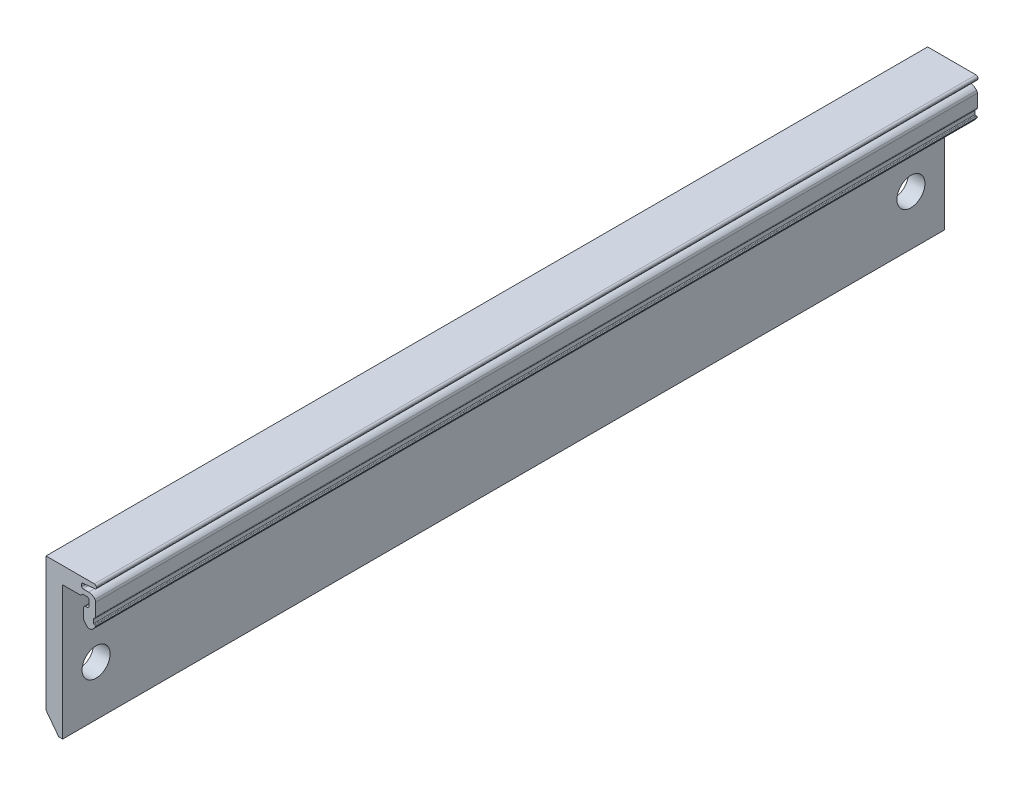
ISO-10303-21;
HEADER;
FILE_DESCRIPTION(('STEP AP214'),'2;1');
FILE_NAME('part.step','',(''),(''),'','','');
FILE_SCHEMA(('AUTOMOTIVE_DESIGN { 1 0 10303 214 1 1 1 1 }'));
ENDSEC;
DATA;
#1=APPLICATION_CONTEXT('core data for automotive mechanical design processes');
#2=APPLICATION_PROTOCOL_DEFINITION('international standard','automotive_design',2000,#1);
#3=PRODUCT_CONTEXT('',#1,'mechanical');
#4=PRODUCT('Part','Part','',(#3));
#5=PRODUCT_RELATED_PRODUCT_CATEGORY('part','',(#4));
#6=PRODUCT_DEFINITION_FORMATION('','',#4);
#7=PRODUCT_DEFINITION_CONTEXT('part definition',#1,'design');
#8=PRODUCT_DEFINITION('design','',#6,#7);
#9=PRODUCT_DEFINITION_SHAPE('','',#8);
#10=(LENGTH_UNIT() NAMED_UNIT(*) SI_UNIT(.MILLI.,.METRE.));
#11=(NAMED_UNIT(*) PLANE_ANGLE_UNIT() SI_UNIT($,.RADIAN.));
#12=(NAMED_UNIT(*) SI_UNIT($,.STERADIAN.) SOLID_ANGLE_UNIT());
#13=UNCERTAINTY_MEASURE_WITH_UNIT(LENGTH_MEASURE(1.E-05),#10,'distance_accuracy_value','');
#14=(GEOMETRIC_REPRESENTATION_CONTEXT(3) GLOBAL_UNCERTAINTY_ASSIGNED_CONTEXT((#13)) GLOBAL_UNIT_ASSIGNED_CONTEXT((#10,
#11,#12)) REPRESENTATION_CONTEXT('',''));
#15=CARTESIAN_POINT('',(0.,0.,0.));
#16=DIRECTION('',(0.,0.,1.));
#17=DIRECTION('',(1.,0.,0.));
#18=AXIS2_PLACEMENT_3D('',#15,#16,#17);
#19=CARTESIAN_POINT('',(2350.3840351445,-3290.10376988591,66.));
#20=DIRECTION('',(0.,-1.,0.));
#21=DIRECTION('',(0.,0.,-1.));
#22=AXIS2_PLACEMENT_3D('',#19,#20,#21);
#23=PLANE('',#22);
#24=DIRECTION('',(-1.,0.,0.));
#25=VECTOR('',#24,1.);
#26=CARTESIAN_POINT('',(2350.3840351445,-3290.10376988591,-66.));
#27=LINE('',#26,#25);
#28=CARTESIAN_POINT('',(2357.62403514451,-3290.10376988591,-66.));
#29=VERTEX_POINT('',#28);
#30=CARTESIAN_POINT('',(2350.3840351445,-3290.10376988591,-66.));
#31=VERTEX_POINT('',#30);
#32=EDGE_CURVE('E178',#29,#31,#27,.T.);
#33=ORIENTED_EDGE('',*,*,#32,.T.);
#34=DIRECTION('',(0.,0.,-1.));
#35=VECTOR('',#34,1.);
#36=CARTESIAN_POINT('',(2350.3840351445,-3290.10376988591,66.));
#37=LINE('',#36,#35);
#38=CARTESIAN_POINT('',(2350.3840351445,-3290.10376988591,66.));
#39=VERTEX_POINT('',#38);
#40=EDGE_CURVE('E11',#39,#31,#37,.T.);
#41=ORIENTED_EDGE('',*,*,#40,.F.);
#42=DIRECTION('',(-1.,0.,0.));
#43=VECTOR('',#42,1.);
#44=CARTESIAN_POINT('',(2355.38403514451,-3290.10376988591,66.));
#45=LINE('',#44,#43);
#46=CARTESIAN_POINT('',(2357.62403514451,-3290.10376988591,66.));
#47=VERTEX_POINT('',#46);
#48=EDGE_CURVE('E184',#47,#39,#45,.T.);
#49=ORIENTED_EDGE('',*,*,#48,.F.);
#50=DIRECTION('',(0.,0.,-1.));
#51=VECTOR('',#50,1.);
#52=CARTESIAN_POINT('',(2357.62403514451,-3290.10376988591,66.));
#53=LINE('',#52,#51);
#54=EDGE_CURVE('E308',#47,#29,#53,.T.);
#55=ORIENTED_EDGE('',*,*,#54,.T.);
#56=EDGE_LOOP('',(#33,#41,#49,#55));
#57=FACE_BOUND('',#56,.T.);
#58=ADVANCED_FACE('F34',(#57),#23,.F.);
#59=CARTESIAN_POINT('',(2350.3840351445,-3292.60376988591,66.));
#60=DIRECTION('',(1.,0.,0.));
#61=DIRECTION('',(0.,0.,-1.));
#62=AXIS2_PLACEMENT_3D('',#59,#60,#61);
#63=PLANE('',#62);
#64=CARTESIAN_POINT('',(2350.38403514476,-3305.10376988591,61.));
#65=DIRECTION('',(-1.,0.,0.));
#66=DIRECTION('',(0.,1.,0.));
#67=AXIS2_PLACEMENT_3D('',#64,#65,#66);
#68=CIRCLE('',#67,2.09999999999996);
#69=CARTESIAN_POINT('',(2350.38403514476,-3303.00376988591,61.));
#70=VERTEX_POINT('',#69);
#71=EDGE_CURVE('E497',#70,#70,#68,.T.);
#72=ORIENTED_EDGE('',*,*,#71,.F.);
#73=EDGE_LOOP('',(#72));
#74=FACE_BOUND('',#73,.T.);
#75=CARTESIAN_POINT('',(2350.38403514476,-3305.10376988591,-61.));
#76=DIRECTION('',(-1.,0.,0.));
#77=DIRECTION('',(0.,-1.,0.));
#78=AXIS2_PLACEMENT_3D('',#75,#76,#77);
#79=CIRCLE('',#78,2.09999999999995);
#80=CARTESIAN_POINT('',(2350.38403514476,-3307.20376988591,-61.));
#81=VERTEX_POINT('',#80);
#82=EDGE_CURVE('E489',#81,#81,#79,.T.);
#83=ORIENTED_EDGE('',*,*,#82,.F.);
#84=EDGE_LOOP('',(#83));
#85=FACE_BOUND('',#84,.T.);
#86=DIRECTION('',(0.,-1.,0.));
#87=VECTOR('',#86,1.);
#88=CARTESIAN_POINT('',(2350.3840351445,-3292.60376988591,-66.));
#89=LINE('',#88,#87);
#90=CARTESIAN_POINT('',(2350.3840351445,-3310.10376988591,-66.));
#91=VERTEX_POINT('',#90);
#92=EDGE_CURVE('E313',#31,#91,#89,.T.);
#93=ORIENTED_EDGE('',*,*,#92,.T.);
#94=DIRECTION('',(0.,0.,-1.));
#95=VECTOR('',#94,1.);
#96=CARTESIAN_POINT('',(2350.3840351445,-3310.10376988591,66.));
#97=LINE('',#96,#95);
#98=CARTESIAN_POINT('',(2350.3840351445,-3310.10376988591,66.));
#99=VERTEX_POINT('',#98);
#100=EDGE_CURVE('E43',#99,#91,#97,.T.);
#101=ORIENTED_EDGE('',*,*,#100,.F.);
#102=DIRECTION('',(0.,-1.,0.));
#103=VECTOR('',#102,1.);
#104=CARTESIAN_POINT('',(2350.3840351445,-3292.60376988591,66.));
#105=LINE('',#104,#103);
#106=EDGE_CURVE('E501',#39,#99,#105,.T.);
#107=ORIENTED_EDGE('',*,*,#106,.F.);
#108=ORIENTED_EDGE('',*,*,#40,.T.);
#109=EDGE_LOOP('',(#93,#101,#107,#108));
#110=FACE_BOUND('',#109,.T.);
#111=ADVANCED_FACE('F583',(#74,#85,#110),#63,.F.);
#112=CARTESIAN_POINT('',(2350.3840351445,-3310.10376988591,66.));
#113=DIRECTION('',(0.796162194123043,0.605083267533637,0.));
#114=DIRECTION('',(-0.605083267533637,0.796162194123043,0.));
#115=AXIS2_PLACEMENT_3D('',#112,#113,#114);
#116=PLANE('',#115);
#117=DIRECTION('',(0.605083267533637,-0.796162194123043,0.));
#118=VECTOR('',#117,1.);
#119=CARTESIAN_POINT('',(2350.3840351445,-3310.10376988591,-66.));
#120=LINE('',#119,#118);
#121=CARTESIAN_POINT('',(2352.2840351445,-3312.60376988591,-66.));
#122=VERTEX_POINT('',#121);
#123=EDGE_CURVE('E316',#91,#122,#120,.T.);
#124=ORIENTED_EDGE('',*,*,#123,.T.);
#125=DIRECTION('',(0.,0.,-1.));
#126=VECTOR('',#125,1.);
#127=CARTESIAN_POINT('',(2352.2840351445,-3312.60376988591,66.));
#128=LINE('',#127,#126);
#129=CARTESIAN_POINT('',(2352.2840351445,-3312.60376988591,66.));
#130=VERTEX_POINT('',#129);
#131=EDGE_CURVE('E484',#130,#122,#128,.T.);
#132=ORIENTED_EDGE('',*,*,#131,.F.);
#133=DIRECTION('',(0.605083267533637,-0.796162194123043,0.));
#134=VECTOR('',#133,1.);
#135=CARTESIAN_POINT('',(2350.3840351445,-3310.10376988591,66.));
#136=LINE('',#135,#134);
#137=EDGE_CURVE('E503',#99,#130,#136,.T.);
#138=ORIENTED_EDGE('',*,*,#137,.F.);
#139=ORIENTED_EDGE('',*,*,#100,.T.);
#140=EDGE_LOOP('',(#124,#132,#138,#139));
#141=FACE_BOUND('',#140,.T.);
#142=ADVANCED_FACE('F589',(#141),#116,.F.);
#143=CARTESIAN_POINT('',(2352.8840351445,-3312.60376988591,66.));
#144=DIRECTION('',(0.,1.,0.));
#145=DIRECTION('',(0.,0.,1.));
#146=AXIS2_PLACEMENT_3D('',#143,#144,#145);
#147=PLANE('',#146);
#148=DIRECTION('',(1.,0.,0.));
#149=VECTOR('',#148,1.);
#150=CARTESIAN_POINT('',(2352.8840351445,-3312.60376988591,-66.));
#151=LINE('',#150,#149);
#152=CARTESIAN_POINT('',(2352.8840351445,-3312.60376988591,-66.));
#153=VERTEX_POINT('',#152);
#154=EDGE_CURVE('E318',#122,#153,#151,.T.);
#155=ORIENTED_EDGE('',*,*,#154,.T.);
#156=DIRECTION('',(0.,0.,-1.));
#157=VECTOR('',#156,1.);
#158=CARTESIAN_POINT('',(2352.8840351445,-3312.60376988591,66.));
#159=LINE('',#158,#157);
#160=CARTESIAN_POINT('',(2352.8840351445,-3312.60376988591,66.));
#161=VERTEX_POINT('',#160);
#162=EDGE_CURVE('E481',#161,#153,#159,.T.);
#163=ORIENTED_EDGE('',*,*,#162,.F.);
#164=DIRECTION('',(1.,0.,0.));
#165=VECTOR('',#164,1.);
#166=CARTESIAN_POINT('',(2352.8840351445,-3312.60376988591,66.));
#167=LINE('',#166,#165);
#168=EDGE_CURVE('E505',#130,#161,#167,.T.);
#169=ORIENTED_EDGE('',*,*,#168,.F.);
#170=ORIENTED_EDGE('',*,*,#131,.T.);
#171=EDGE_LOOP('',(#155,#163,#169,#170));
#172=FACE_BOUND('',#171,.T.);
#173=ADVANCED_FACE('F593',(#172),#147,.F.);
#174=CARTESIAN_POINT('',(2352.88403514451,-3292.60376988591,66.));
#175=DIRECTION('',(-1.,0.,0.));
#176=DIRECTION('',(0.,-1.,0.));
#177=AXIS2_PLACEMENT_3D('',#174,#175,#176);
#178=PLANE('',#177);
#179=CARTESIAN_POINT('',(2352.88403514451,-3305.10376988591,61.));
#180=DIRECTION('',(-1.,0.,0.));
#181=DIRECTION('',(0.,-1.,0.));
#182=AXIS2_PLACEMENT_3D('',#179,#180,#181);
#183=CIRCLE('',#182,2.09999999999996);
#184=CARTESIAN_POINT('',(2352.88403514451,-3307.20376988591,61.));
#185=VERTEX_POINT('',#184);
#186=EDGE_CURVE('E37',#185,#185,#183,.T.);
#187=ORIENTED_EDGE('',*,*,#186,.T.);
#188=EDGE_LOOP('',(#187));
#189=FACE_BOUND('',#188,.T.);
#190=CARTESIAN_POINT('',(2352.88403514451,-3305.10376988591,-61.));
#191=DIRECTION('',(-1.,0.,0.));
#192=DIRECTION('',(0.,-1.,0.));
#193=AXIS2_PLACEMENT_3D('',#190,#191,#192);
#194=CIRCLE('',#193,2.09999999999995);
#195=CARTESIAN_POINT('',(2352.88403514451,-3307.20376988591,-61.));
#196=VERTEX_POINT('',#195);
#197=EDGE_CURVE('E314',#196,#196,#194,.T.);
#198=ORIENTED_EDGE('',*,*,#197,.T.);
#199=EDGE_LOOP('',(#198));
#200=FACE_BOUND('',#199,.T.);
#201=DIRECTION('',(0.,1.,0.));
#202=VECTOR('',#201,1.);
#203=CARTESIAN_POINT('',(2352.88403514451,-3292.60376988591,-66.));
#204=LINE('',#203,#202);
#205=CARTESIAN_POINT('',(2352.88403514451,-3292.60376988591,-66.));
#206=VERTEX_POINT('',#205);
#207=EDGE_CURVE('E320',#153,#206,#204,.T.);
#208=ORIENTED_EDGE('',*,*,#207,.T.);
#209=DIRECTION('',(0.,0.,-1.));
#210=VECTOR('',#209,1.);
#211=CARTESIAN_POINT('',(2352.88403514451,-3292.60376988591,66.));
#212=LINE('',#211,#210);
#213=CARTESIAN_POINT('',(2352.88403514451,-3292.60376988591,66.));
#214=VERTEX_POINT('',#213);
#215=EDGE_CURVE('E478',#214,#206,#212,.T.);
#216=ORIENTED_EDGE('',*,*,#215,.F.);
#217=DIRECTION('',(0.,1.,0.));
#218=VECTOR('',#217,1.);
#219=CARTESIAN_POINT('',(2352.88403514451,-3292.60376988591,66.));
#220=LINE('',#219,#218);
#221=EDGE_CURVE('E507',#161,#214,#220,.T.);
#222=ORIENTED_EDGE('',*,*,#221,.F.);
#223=ORIENTED_EDGE('',*,*,#162,.T.);
#224=EDGE_LOOP('',(#208,#216,#222,#223));
#225=FACE_BOUND('',#224,.T.);
#226=ADVANCED_FACE('F598',(#189,#200,#225),#178,.F.);
#227=CARTESIAN_POINT('',(2355.38403514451,-3292.60376988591,66.));
#228=DIRECTION('',(0.,1.,0.));
#229=DIRECTION('',(0.,0.,1.));
#230=AXIS2_PLACEMENT_3D('',#227,#228,#229);
#231=PLANE('',#230);
#232=DIRECTION('',(1.,0.,0.));
#233=VECTOR('',#232,1.);
#234=CARTESIAN_POINT('',(2355.38403514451,-3292.60376988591,-66.));
#235=LINE('',#234,#233);
#236=CARTESIAN_POINT('',(2355.46834905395,-3292.60376988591,-66.));
#237=VERTEX_POINT('',#236);
#238=EDGE_CURVE('E323',#206,#237,#235,.T.);
#239=ORIENTED_EDGE('',*,*,#238,.T.);
#240=DIRECTION('',(0.,0.,-1.));
#241=VECTOR('',#240,1.);
#242=CARTESIAN_POINT('',(2355.46834905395,-3292.60376988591,66.));
#243=LINE('',#242,#241);
#244=CARTESIAN_POINT('',(2355.46834905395,-3292.60376988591,66.));
#245=VERTEX_POINT('',#244);
#246=EDGE_CURVE('E475',#245,#237,#243,.T.);
#247=ORIENTED_EDGE('',*,*,#246,.F.);
#248=DIRECTION('',(1.,-3.55271367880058E-13,0.));
#249=VECTOR('',#248,1.);
#250=CARTESIAN_POINT('',(2352.88403514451,-3292.60376988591,66.));
#251=LINE('',#250,#249);
#252=EDGE_CURVE('E509',#214,#245,#251,.T.);
#253=ORIENTED_EDGE('',*,*,#252,.F.);
#254=ORIENTED_EDGE('',*,*,#215,.T.);
#255=EDGE_LOOP('',(#239,#247,#253,#254));
#256=FACE_BOUND('',#255,.T.);
#257=ADVANCED_FACE('F604',(#256),#231,.F.);
#258=CARTESIAN_POINT('',(2355.46834905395,-3292.30376988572,66.));
#259=DIRECTION('',(0.,0.,-1.));
#260=DIRECTION('',(-1.,0.,0.));
#261=AXIS2_PLACEMENT_3D('',#258,#259,#260);
#262=CYLINDRICAL_SURFACE('',#261,0.300000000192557);
#263=CARTESIAN_POINT('',(2355.46834905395,-3292.30376988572,-66.));
#264=DIRECTION('',(0.,0.,1.));
#265=DIRECTION('',(-1.,0.,0.));
#266=AXIS2_PLACEMENT_3D('',#263,#264,#265);
#267=CIRCLE('',#266,0.300000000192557);
#268=CARTESIAN_POINT('',(2355.72815667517,-3292.45376988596,-66.));
#269=VERTEX_POINT('',#268);
#270=EDGE_CURVE('E325',#237,#269,#267,.T.);
#271=ORIENTED_EDGE('',*,*,#270,.T.);
#272=DIRECTION('',(0.,0.,-1.));
#273=VECTOR('',#272,1.);
#274=CARTESIAN_POINT('',(2355.72815667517,-3292.45376988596,66.));
#275=LINE('',#274,#273);
#276=CARTESIAN_POINT('',(2355.72815667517,-3292.45376988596,66.));
#277=VERTEX_POINT('',#276);
#278=EDGE_CURVE('E472',#277,#269,#275,.T.);
#279=ORIENTED_EDGE('',*,*,#278,.F.);
#280=CARTESIAN_POINT('',(2355.46834905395,-3292.30376988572,66.));
#281=DIRECTION('',(0.,0.,1.));
#282=DIRECTION('',(-1.,0.,0.));
#283=AXIS2_PLACEMENT_3D('',#280,#281,#282);
#284=CIRCLE('',#283,0.300000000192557);
#285=EDGE_CURVE('E511',#245,#277,#284,.T.);
#286=ORIENTED_EDGE('',*,*,#285,.F.);
#287=ORIENTED_EDGE('',*,*,#246,.T.);
#288=EDGE_LOOP('',(#271,#279,#286,#287));
#289=FACE_BOUND('',#288,.T.);
#290=ADVANCED_FACE('F607',(#289),#262,.T.);
#291=CARTESIAN_POINT('',(2355.9879642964,-3292.60376988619,66.));
#292=DIRECTION('',(0.,0.,-1.));
#293=DIRECTION('',(-1.,0.,0.));
#294=AXIS2_PLACEMENT_3D('',#291,#292,#293);
#295=CYLINDRICAL_SURFACE('',#294,0.300000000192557);
#296=CARTESIAN_POINT('',(2355.9879642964,-3292.60376988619,-66.));
#297=DIRECTION('',(0.,0.,-1.));
#298=DIRECTION('',(-1.,0.,0.));
#299=AXIS2_PLACEMENT_3D('',#296,#297,#298);
#300=CIRCLE('',#299,0.300000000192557);
#301=CARTESIAN_POINT('',(2355.9879642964,-3292.303769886,-66.));
#302=VERTEX_POINT('',#301);
#303=EDGE_CURVE('E327',#269,#302,#300,.T.);
#304=ORIENTED_EDGE('',*,*,#303,.T.);
#305=DIRECTION('',(0.,0.,-1.));
#306=VECTOR('',#305,1.);
#307=CARTESIAN_POINT('',(2355.9879642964,-3292.303769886,66.));
#308=LINE('',#307,#306);
#309=CARTESIAN_POINT('',(2355.9879642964,-3292.303769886,66.));
#310=VERTEX_POINT('',#309);
#311=EDGE_CURVE('E469',#310,#302,#308,.T.);
#312=ORIENTED_EDGE('',*,*,#311,.F.);
#313=CARTESIAN_POINT('',(2355.9879642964,-3292.60376988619,66.));
#314=DIRECTION('',(0.,0.,-1.));
#315=DIRECTION('',(-1.,0.,0.));
#316=AXIS2_PLACEMENT_3D('',#313,#314,#315);
#317=CIRCLE('',#316,0.300000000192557);
#318=EDGE_CURVE('E513',#277,#310,#317,.T.);
#319=ORIENTED_EDGE('',*,*,#318,.F.);
#320=ORIENTED_EDGE('',*,*,#278,.T.);
#321=EDGE_LOOP('',(#304,#312,#319,#320));
#322=FACE_BOUND('',#321,.T.);
#323=ADVANCED_FACE('F612',(#322),#295,.F.);
#324=CARTESIAN_POINT('',(2356.52403514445,-3292.303769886,66.));
#325=DIRECTION('',(0.,1.,0.));
#326=DIRECTION('',(0.,0.,1.));
#327=AXIS2_PLACEMENT_3D('',#324,#325,#326);
#328=PLANE('',#327);
#329=DIRECTION('',(1.,0.,0.));
#330=VECTOR('',#329,1.);
#331=CARTESIAN_POINT('',(2356.52403514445,-3292.303769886,-66.));
#332=LINE('',#331,#330);
#333=CARTESIAN_POINT('',(2356.52403514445,-3292.303769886,-66.));
#334=VERTEX_POINT('',#333);
#335=EDGE_CURVE('E329',#302,#334,#332,.T.);
#336=ORIENTED_EDGE('',*,*,#335,.T.);
#337=DIRECTION('',(0.,0.,-1.));
#338=VECTOR('',#337,1.);
#339=CARTESIAN_POINT('',(2356.52403514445,-3292.303769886,66.));
#340=LINE('',#339,#338);
#341=CARTESIAN_POINT('',(2356.52403514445,-3292.303769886,66.));
#342=VERTEX_POINT('',#341);
#343=EDGE_CURVE('E466',#342,#334,#340,.T.);
#344=ORIENTED_EDGE('',*,*,#343,.F.);
#345=DIRECTION('',(1.,0.,0.));
#346=VECTOR('',#345,1.);
#347=CARTESIAN_POINT('',(2356.52403514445,-3292.303769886,66.));
#348=LINE('',#347,#346);
#349=EDGE_CURVE('E515',#310,#342,#348,.T.);
#350=ORIENTED_EDGE('',*,*,#349,.F.);
#351=ORIENTED_EDGE('',*,*,#311,.T.);
#352=EDGE_LOOP('',(#336,#344,#350,#351));
#353=FACE_BOUND('',#352,.T.);
#354=ADVANCED_FACE('F618',(#353),#328,.F.);
#355=CARTESIAN_POINT('',(2356.52403514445,-3292.603769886,66.));
#356=DIRECTION('',(0.,0.,-1.));
#357=DIRECTION('',(-1.,0.,0.));
#358=AXIS2_PLACEMENT_3D('',#355,#356,#357);
#359=CYLINDRICAL_SURFACE('',#358,0.300000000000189);
#360=CARTESIAN_POINT('',(2356.52403514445,-3292.603769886,-66.));
#361=DIRECTION('',(0.,0.,-1.));
#362=DIRECTION('',(-1.,0.,0.));
#363=AXIS2_PLACEMENT_3D('',#360,#361,#362);
#364=CIRCLE('',#363,0.300000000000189);
#365=CARTESIAN_POINT('',(2356.82403514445,-3292.603769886,-66.));
#366=VERTEX_POINT('',#365);
#367=EDGE_CURVE('E331',#334,#366,#364,.T.);
#368=ORIENTED_EDGE('',*,*,#367,.T.);
#369=DIRECTION('',(0.,0.,-1.));
#370=VECTOR('',#369,1.);
#371=CARTESIAN_POINT('',(2356.82403514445,-3292.603769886,66.));
#372=LINE('',#371,#370);
#373=CARTESIAN_POINT('',(2356.82403514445,-3292.603769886,66.));
#374=VERTEX_POINT('',#373);
#375=EDGE_CURVE('E463',#374,#366,#372,.T.);
#376=ORIENTED_EDGE('',*,*,#375,.F.);
#377=CARTESIAN_POINT('',(2356.52403514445,-3292.603769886,66.));
#378=DIRECTION('',(0.,0.,-1.));
#379=DIRECTION('',(-1.,0.,0.));
#380=AXIS2_PLACEMENT_3D('',#377,#378,#379);
#381=CIRCLE('',#380,0.300000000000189);
#382=EDGE_CURVE('E517',#342,#374,#381,.T.);
#383=ORIENTED_EDGE('',*,*,#382,.F.);
#384=ORIENTED_EDGE('',*,*,#343,.T.);
#385=EDGE_LOOP('',(#368,#376,#383,#384));
#386=FACE_BOUND('',#385,.T.);
#387=ADVANCED_FACE('F622',(#386),#359,.F.);
#388=CARTESIAN_POINT('',(2356.82403514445,-3293.40376988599,66.));
#389=DIRECTION('',(1.,0.,0.));
#390=DIRECTION('',(0.,0.,-1.));
#391=AXIS2_PLACEMENT_3D('',#388,#389,#390);
#392=PLANE('',#391);
#393=DIRECTION('',(0.,-1.,0.));
#394=VECTOR('',#393,1.);
#395=CARTESIAN_POINT('',(2356.82403514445,-3293.40376988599,-66.));
#396=LINE('',#395,#394);
#397=CARTESIAN_POINT('',(2356.82403514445,-3293.40376988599,-66.));
#398=VERTEX_POINT('',#397);
#399=EDGE_CURVE('E333',#366,#398,#396,.T.);
#400=ORIENTED_EDGE('',*,*,#399,.T.);
#401=DIRECTION('',(0.,0.,-1.));
#402=VECTOR('',#401,1.);
#403=CARTESIAN_POINT('',(2356.82403514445,-3293.40376988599,66.));
#404=LINE('',#403,#402);
#405=CARTESIAN_POINT('',(2356.82403514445,-3293.40376988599,66.));
#406=VERTEX_POINT('',#405);
#407=EDGE_CURVE('E460',#406,#398,#404,.T.);
#408=ORIENTED_EDGE('',*,*,#407,.F.);
#409=DIRECTION('',(0.,-1.,0.));
#410=VECTOR('',#409,1.);
#411=CARTESIAN_POINT('',(2356.82403514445,-3293.40376988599,66.));
#412=LINE('',#411,#410);
#413=EDGE_CURVE('E519',#374,#406,#412,.T.);
#414=ORIENTED_EDGE('',*,*,#413,.F.);
#415=ORIENTED_EDGE('',*,*,#375,.T.);
#416=EDGE_LOOP('',(#400,#408,#414,#415));
#417=FACE_BOUND('',#416,.T.);
#418=ADVANCED_FACE('F627',(#417),#392,.F.);
#419=CARTESIAN_POINT('',(2356.52403514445,-3293.40376988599,66.));
#420=DIRECTION('',(0.,0.,-1.));
#421=DIRECTION('',(-1.,0.,0.));
#422=AXIS2_PLACEMENT_3D('',#419,#420,#421);
#423=CYLINDRICAL_SURFACE('',#422,0.300000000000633);
#424=CARTESIAN_POINT('',(2356.52403514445,-3293.40376988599,-66.));
#425=DIRECTION('',(0.,0.,-1.));
#426=DIRECTION('',(-1.,0.,0.));
#427=AXIS2_PLACEMENT_3D('',#424,#425,#426);
#428=CIRCLE('',#427,0.300000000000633);
#429=CARTESIAN_POINT('',(2356.52403514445,-3293.70376988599,-66.));
#430=VERTEX_POINT('',#429);
#431=EDGE_CURVE('E335',#398,#430,#428,.T.);
#432=ORIENTED_EDGE('',*,*,#431,.T.);
#433=DIRECTION('',(0.,0.,-1.));
#434=VECTOR('',#433,1.);
#435=CARTESIAN_POINT('',(2356.52403514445,-3293.70376988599,66.));
#436=LINE('',#435,#434);
#437=CARTESIAN_POINT('',(2356.52403514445,-3293.70376988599,66.));
#438=VERTEX_POINT('',#437);
#439=EDGE_CURVE('E457',#438,#430,#436,.T.);
#440=ORIENTED_EDGE('',*,*,#439,.F.);
#441=CARTESIAN_POINT('',(2356.52403514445,-3293.40376988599,66.));
#442=DIRECTION('',(0.,0.,-1.));
#443=DIRECTION('',(-1.,0.,0.));
#444=AXIS2_PLACEMENT_3D('',#441,#442,#443);
#445=CIRCLE('',#444,0.300000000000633);
#446=EDGE_CURVE('E521',#406,#438,#445,.T.);
#447=ORIENTED_EDGE('',*,*,#446,.F.);
#448=ORIENTED_EDGE('',*,*,#407,.T.);
#449=EDGE_LOOP('',(#432,#440,#447,#448));
#450=FACE_BOUND('',#449,.T.);
#451=ADVANCED_FACE('F633',(#450),#423,.F.);
#452=CARTESIAN_POINT('',(2356.32403514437,-3293.70376988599,66.));
#453=DIRECTION('',(0.,-1.,0.));
#454=DIRECTION('',(0.,0.,-1.));
#455=AXIS2_PLACEMENT_3D('',#452,#453,#454);
#456=PLANE('',#455);
#457=DIRECTION('',(-1.,0.,0.));
#458=VECTOR('',#457,1.);
#459=CARTESIAN_POINT('',(2356.32403514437,-3293.70376988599,-66.));
#460=LINE('',#459,#458);
#461=CARTESIAN_POINT('',(2356.32403514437,-3293.70376988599,-66.));
#462=VERTEX_POINT('',#461);
#463=EDGE_CURVE('E337',#430,#462,#460,.T.);
#464=ORIENTED_EDGE('',*,*,#463,.T.);
#465=DIRECTION('',(0.,0.,-1.));
#466=VECTOR('',#465,1.);
#467=CARTESIAN_POINT('',(2356.32403514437,-3293.70376988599,66.));
#468=LINE('',#467,#466);
#469=CARTESIAN_POINT('',(2356.32403514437,-3293.70376988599,66.));
#470=VERTEX_POINT('',#469);
#471=EDGE_CURVE('E454',#470,#462,#468,.T.);
#472=ORIENTED_EDGE('',*,*,#471,.F.);
#473=DIRECTION('',(-1.,0.,0.));
#474=VECTOR('',#473,1.);
#475=CARTESIAN_POINT('',(2356.32403514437,-3293.70376988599,66.));
#476=LINE('',#475,#474);
#477=EDGE_CURVE('E523',#438,#470,#476,.T.);
#478=ORIENTED_EDGE('',*,*,#477,.F.);
#479=ORIENTED_EDGE('',*,*,#439,.T.);
#480=EDGE_LOOP('',(#464,#472,#478,#479));
#481=FACE_BOUND('',#480,.T.);
#482=ADVANCED_FACE('F637',(#481),#456,.F.);
#483=CARTESIAN_POINT('',(2356.32403514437,-3294.003769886,66.));
#484=DIRECTION('',(0.,0.,-1.));
#485=DIRECTION('',(-1.,0.,0.));
#486=AXIS2_PLACEMENT_3D('',#483,#484,#485);
#487=CYLINDRICAL_SURFACE('',#486,0.300000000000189);
#488=CARTESIAN_POINT('',(2356.32403514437,-3294.003769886,-66.));
#489=DIRECTION('',(0.,0.,1.));
#490=DIRECTION('',(-1.,0.,0.));
#491=AXIS2_PLACEMENT_3D('',#488,#489,#490);
#492=CIRCLE('',#491,0.300000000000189);
#493=CARTESIAN_POINT('',(2356.02403514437,-3294.003769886,-66.));
#494=VERTEX_POINT('',#493);
#495=EDGE_CURVE('E339',#462,#494,#492,.T.);
#496=ORIENTED_EDGE('',*,*,#495,.T.);
#497=DIRECTION('',(0.,0.,-1.));
#498=VECTOR('',#497,1.);
#499=CARTESIAN_POINT('',(2356.02403514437,-3294.003769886,66.));
#500=LINE('',#499,#498);
#501=CARTESIAN_POINT('',(2356.02403514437,-3294.003769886,66.));
#502=VERTEX_POINT('',#501);
#503=EDGE_CURVE('E451',#502,#494,#500,.T.);
#504=ORIENTED_EDGE('',*,*,#503,.F.);
#505=CARTESIAN_POINT('',(2356.32403514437,-3294.003769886,66.));
#506=DIRECTION('',(0.,0.,1.));
#507=DIRECTION('',(-1.,0.,0.));
#508=AXIS2_PLACEMENT_3D('',#505,#506,#507);
#509=CIRCLE('',#508,0.300000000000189);
#510=EDGE_CURVE('E525',#470,#502,#509,.T.);
#511=ORIENTED_EDGE('',*,*,#510,.F.);
#512=ORIENTED_EDGE('',*,*,#471,.T.);
#513=EDGE_LOOP('',(#496,#504,#511,#512));
#514=FACE_BOUND('',#513,.T.);
#515=ADVANCED_FACE('F642',(#514),#487,.T.);
#516=CARTESIAN_POINT('',(2356.02403514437,-3295.45454467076,66.));
#517=DIRECTION('',(1.,3.06104858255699E-13,0.));
#518=DIRECTION('',(-3.06104858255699E-13,1.,0.));
#519=AXIS2_PLACEMENT_3D('',#516,#517,#518);
#520=PLANE('',#519);
#521=DIRECTION('',(3.06104858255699E-13,-1.,0.));
#522=VECTOR('',#521,1.);
#523=CARTESIAN_POINT('',(2356.02403514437,-3295.45454467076,-66.));
#524=LINE('',#523,#522);
#525=CARTESIAN_POINT('',(2356.02403514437,-3295.45454467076,-66.));
#526=VERTEX_POINT('',#525);
#527=EDGE_CURVE('E341',#494,#526,#524,.T.);
#528=ORIENTED_EDGE('',*,*,#527,.T.);
#529=DIRECTION('',(0.,0.,-1.));
#530=VECTOR('',#529,1.);
#531=CARTESIAN_POINT('',(2356.02403514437,-3295.45454467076,66.));
#532=LINE('',#531,#530);
#533=CARTESIAN_POINT('',(2356.02403514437,-3295.45454467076,66.));
#534=VERTEX_POINT('',#533);
#535=EDGE_CURVE('E448',#534,#526,#532,.T.);
#536=ORIENTED_EDGE('',*,*,#535,.F.);
#537=DIRECTION('',(3.06104858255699E-13,-1.,0.));
#538=VECTOR('',#537,1.);
#539=CARTESIAN_POINT('',(2356.02403514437,-3295.45454467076,66.));
#540=LINE('',#539,#538);
#541=EDGE_CURVE('E527',#502,#534,#540,.T.);
#542=ORIENTED_EDGE('',*,*,#541,.F.);
#543=ORIENTED_EDGE('',*,*,#503,.T.);
#544=EDGE_LOOP('',(#528,#536,#542,#543));
#545=FACE_BOUND('',#544,.T.);
#546=ADVANCED_FACE('F648',(#545),#520,.F.);
#547=CARTESIAN_POINT('',(2356.3240351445,-3295.45454467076,66.));
#548=DIRECTION('',(0.,0.,-1.));
#549=DIRECTION('',(-1.,0.,0.));
#550=AXIS2_PLACEMENT_3D('',#547,#548,#549);
#551=CYLINDRICAL_SURFACE('',#550,0.300000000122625);
#552=CARTESIAN_POINT('',(2356.3240351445,-3295.45454467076,-66.));
#553=DIRECTION('',(0.,0.,1.));
#554=DIRECTION('',(-1.,0.,0.));
#555=AXIS2_PLACEMENT_3D('',#552,#553,#554);
#556=CIRCLE('',#555,0.300000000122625);
#557=CARTESIAN_POINT('',(2356.09426057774,-3295.64742714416,-66.));
#558=VERTEX_POINT('',#557);
#559=EDGE_CURVE('E343',#526,#558,#556,.T.);
#560=ORIENTED_EDGE('',*,*,#559,.T.);
#561=DIRECTION('',(0.,0.,-1.));
#562=VECTOR('',#561,1.);
#563=CARTESIAN_POINT('',(2356.09426057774,-3295.64742714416,66.));
#564=LINE('',#563,#562);
#565=CARTESIAN_POINT('',(2356.09426057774,-3295.64742714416,66.));
#566=VERTEX_POINT('',#565);
#567=EDGE_CURVE('E445',#566,#558,#564,.T.);
#568=ORIENTED_EDGE('',*,*,#567,.F.);
#569=CARTESIAN_POINT('',(2356.3240351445,-3295.45454467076,66.));
#570=DIRECTION('',(0.,0.,1.));
#571=DIRECTION('',(-1.,0.,0.));
#572=AXIS2_PLACEMENT_3D('',#569,#570,#571);
#573=CIRCLE('',#572,0.300000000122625);
#574=EDGE_CURVE('E529',#534,#566,#573,.T.);
#575=ORIENTED_EDGE('',*,*,#574,.F.);
#576=ORIENTED_EDGE('',*,*,#535,.T.);
#577=EDGE_LOOP('',(#560,#568,#575,#576));
#578=FACE_BOUND('',#577,.T.);
#579=ADVANCED_FACE('F652',(#578),#551,.T.);
#580=CARTESIAN_POINT('',(2356.46501305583,-3296.08909241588,66.));
#581=DIRECTION('',(0.765915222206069,0.642941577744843,0.));
#582=DIRECTION('',(-0.642941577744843,0.765915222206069,0.));
#583=AXIS2_PLACEMENT_3D('',#580,#581,#582);
#584=PLANE('',#583);
#585=DIRECTION('',(0.642941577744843,-0.765915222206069,0.));
#586=VECTOR('',#585,1.);
#587=CARTESIAN_POINT('',(2356.46501305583,-3296.08909241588,-66.));
#588=LINE('',#587,#586);
#589=CARTESIAN_POINT('',(2356.46501305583,-3296.08909241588,-66.));
#590=VERTEX_POINT('',#589);
#591=EDGE_CURVE('E345',#558,#590,#588,.T.);
#592=ORIENTED_EDGE('',*,*,#591,.T.);
#593=DIRECTION('',(0.,0.,-1.));
#594=VECTOR('',#593,1.);
#595=CARTESIAN_POINT('',(2356.46501305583,-3296.08909241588,66.));
#596=LINE('',#595,#594);
#597=CARTESIAN_POINT('',(2356.46501305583,-3296.08909241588,66.));
#598=VERTEX_POINT('',#597);
#599=EDGE_CURVE('E442',#598,#590,#596,.T.);
#600=ORIENTED_EDGE('',*,*,#599,.F.);
#601=DIRECTION('',(0.642941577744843,-0.765915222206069,0.));
#602=VECTOR('',#601,1.);
#603=CARTESIAN_POINT('',(2356.46501305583,-3296.08909241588,66.));
#604=LINE('',#603,#602);
#605=EDGE_CURVE('E531',#566,#598,#604,.T.);
#606=ORIENTED_EDGE('',*,*,#605,.F.);
#607=ORIENTED_EDGE('',*,*,#567,.T.);
#608=EDGE_LOOP('',(#592,#600,#606,#607));
#609=FACE_BOUND('',#608,.T.);
#610=ADVANCED_FACE('F657',(#609),#584,.F.);
#611=CARTESIAN_POINT('',(2356.92403515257,-3295.703769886,66.));
#612=DIRECTION('',(0.,0.,-1.));
#613=DIRECTION('',(-1.,0.,0.));
#614=AXIS2_PLACEMENT_3D('',#611,#612,#613);
#615=CYLINDRICAL_SURFACE('',#614,0.599311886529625);
#616=CARTESIAN_POINT('',(2356.92403515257,-3295.703769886,-66.));
#617=DIRECTION('',(0.,0.,1.));
#618=DIRECTION('',(-1.,0.,0.));
#619=AXIS2_PLACEMENT_3D('',#616,#617,#618);
#620=CIRCLE('',#619,0.599311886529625);
#621=CARTESIAN_POINT('',(2357.38305725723,-3296.08909240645,-66.));
#622=VERTEX_POINT('',#621);
#623=EDGE_CURVE('E347',#590,#622,#620,.T.);
#624=ORIENTED_EDGE('',*,*,#623,.T.);
#625=DIRECTION('',(0.,0.,-1.));
#626=VECTOR('',#625,1.);
#627=CARTESIAN_POINT('',(2357.38305725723,-3296.08909240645,66.));
#628=LINE('',#627,#626);
#629=CARTESIAN_POINT('',(2357.38305725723,-3296.08909240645,66.));
#630=VERTEX_POINT('',#629);
#631=EDGE_CURVE('E439',#630,#622,#628,.T.);
#632=ORIENTED_EDGE('',*,*,#631,.F.);
#633=CARTESIAN_POINT('',(2356.92403515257,-3295.703769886,66.));
#634=DIRECTION('',(0.,0.,1.));
#635=DIRECTION('',(-1.,0.,0.));
#636=AXIS2_PLACEMENT_3D('',#633,#634,#635);
#637=CIRCLE('',#636,0.599311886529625);
#638=EDGE_CURVE('E533',#598,#630,#637,.T.);
#639=ORIENTED_EDGE('',*,*,#638,.F.);
#640=ORIENTED_EDGE('',*,*,#599,.T.);
#641=EDGE_LOOP('',(#624,#632,#639,#640));
#642=FACE_BOUND('',#641,.T.);
#643=ADVANCED_FACE('F663',(#642),#615,.T.);
#644=CARTESIAN_POINT('',(2357.80062666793,-3295.59165563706,66.));
#645=DIRECTION('',(-0.765915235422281,0.642941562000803,0.));
#646=DIRECTION('',(-0.642941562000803,-0.765915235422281,0.));
#647=AXIS2_PLACEMENT_3D('',#644,#645,#646);
#648=PLANE('',#647);
#649=DIRECTION('',(0.642941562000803,0.765915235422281,0.));
#650=VECTOR('',#649,1.);
#651=CARTESIAN_POINT('',(2357.80062666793,-3295.59165563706,-66.));
#652=LINE('',#651,#650);
#653=CARTESIAN_POINT('',(2357.80062666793,-3295.59165563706,-66.));
#654=VERTEX_POINT('',#653);
#655=EDGE_CURVE('E349',#622,#654,#652,.T.);
#656=ORIENTED_EDGE('',*,*,#655,.T.);
#657=DIRECTION('',(0.,0.,-1.));
#658=VECTOR('',#657,1.);
#659=CARTESIAN_POINT('',(2357.80062666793,-3295.59165563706,66.));
#660=LINE('',#659,#658);
#661=CARTESIAN_POINT('',(2357.80062666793,-3295.59165563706,66.));
#662=VERTEX_POINT('',#661);
#663=EDGE_CURVE('E436',#662,#654,#660,.T.);
#664=ORIENTED_EDGE('',*,*,#663,.F.);
#665=DIRECTION('',(0.642941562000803,0.765915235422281,0.));
#666=VECTOR('',#665,1.);
#667=CARTESIAN_POINT('',(2357.80062666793,-3295.59165563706,66.));
#668=LINE('',#667,#666);
#669=EDGE_CURVE('E535',#630,#662,#668,.T.);
#670=ORIENTED_EDGE('',*,*,#669,.F.);
#671=ORIENTED_EDGE('',*,*,#631,.T.);
#672=EDGE_LOOP('',(#656,#664,#670,#671));
#673=FACE_BOUND('',#672,.T.);
#674=ADVANCED_FACE('F667',(#673),#648,.F.);
#675=CARTESIAN_POINT('',(2357.7240351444,-3295.52736148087,66.));
#676=DIRECTION('',(0.,0.,-1.));
#677=DIRECTION('',(-1.,0.,0.));
#678=AXIS2_PLACEMENT_3D('',#675,#676,#677);
#679=CYLINDRICAL_SURFACE('',#678,0.0999999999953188);
#680=CARTESIAN_POINT('',(2357.7240351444,-3295.52736148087,-66.));
#681=DIRECTION('',(0.,0.,1.));
#682=DIRECTION('',(-1.,0.,0.));
#683=AXIS2_PLACEMENT_3D('',#680,#681,#682);
#684=CIRCLE('',#683,0.0999999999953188);
#685=CARTESIAN_POINT('',(2357.82403514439,-3295.52736148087,-66.));
#686=VERTEX_POINT('',#685);
#687=EDGE_CURVE('E351',#654,#686,#684,.T.);
#688=ORIENTED_EDGE('',*,*,#687,.T.);
#689=DIRECTION('',(0.,0.,-1.));
#690=VECTOR('',#689,1.);
#691=CARTESIAN_POINT('',(2357.82403514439,-3295.52736148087,66.));
#692=LINE('',#691,#690);
#693=CARTESIAN_POINT('',(2357.82403514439,-3295.52736148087,66.));
#694=VERTEX_POINT('',#693);
#695=EDGE_CURVE('E433',#694,#686,#692,.T.);
#696=ORIENTED_EDGE('',*,*,#695,.F.);
#697=CARTESIAN_POINT('',(2357.7240351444,-3295.52736148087,66.));
#698=DIRECTION('',(0.,0.,1.));
#699=DIRECTION('',(-1.,0.,0.));
#700=AXIS2_PLACEMENT_3D('',#697,#698,#699);
#701=CIRCLE('',#700,0.0999999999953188);
#702=EDGE_CURVE('E537',#662,#694,#701,.T.);
#703=ORIENTED_EDGE('',*,*,#702,.F.);
#704=ORIENTED_EDGE('',*,*,#663,.T.);
#705=EDGE_LOOP('',(#688,#696,#703,#704));
#706=FACE_BOUND('',#705,.T.);
#707=ADVANCED_FACE('F672',(#706),#679,.T.);
#708=CARTESIAN_POINT('',(2357.82403514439,-3295.50795991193,66.));
#709=DIRECTION('',(-1.,0.,0.));
#710=DIRECTION('',(0.,0.,1.));
#711=AXIS2_PLACEMENT_3D('',#708,#709,#710);
#712=PLANE('',#711);
#713=DIRECTION('',(0.,1.,0.));
#714=VECTOR('',#713,1.);
#715=CARTESIAN_POINT('',(2357.82403514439,-3295.50795991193,-66.));
#716=LINE('',#715,#714);
#717=CARTESIAN_POINT('',(2357.82403514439,-3295.50795991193,-66.));
#718=VERTEX_POINT('',#717);
#719=EDGE_CURVE('E353',#686,#718,#716,.T.);
#720=ORIENTED_EDGE('',*,*,#719,.T.);
#721=DIRECTION('',(0.,0.,-1.));
#722=VECTOR('',#721,1.);
#723=CARTESIAN_POINT('',(2357.82403514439,-3295.50795991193,66.));
#724=LINE('',#723,#722);
#725=CARTESIAN_POINT('',(2357.82403514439,-3295.50795991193,66.));
#726=VERTEX_POINT('',#725);
#727=EDGE_CURVE('E430',#726,#718,#724,.T.);
#728=ORIENTED_EDGE('',*,*,#727,.F.);
#729=DIRECTION('',(0.,1.,0.));
#730=VECTOR('',#729,1.);
#731=CARTESIAN_POINT('',(2357.82403514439,-3295.50795991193,66.));
#732=LINE('',#731,#730);
#733=EDGE_CURVE('E539',#694,#726,#732,.T.);
#734=ORIENTED_EDGE('',*,*,#733,.F.);
#735=ORIENTED_EDGE('',*,*,#695,.T.);
#736=EDGE_LOOP('',(#720,#728,#734,#735));
#737=FACE_BOUND('',#736,.T.);
#738=ADVANCED_FACE('F678',(#737),#712,.F.);
#739=CARTESIAN_POINT('',(2357.72403514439,-3295.50795991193,66.));
#740=DIRECTION('',(0.,0.,-1.));
#741=DIRECTION('',(-1.,0.,0.));
#742=AXIS2_PLACEMENT_3D('',#739,#740,#741);
#743=CYLINDRICAL_SURFACE('',#742,0.0999999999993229);
#744=CARTESIAN_POINT('',(2357.72403514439,-3295.50795991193,-66.));
#745=DIRECTION('',(0.,0.,1.));
#746=DIRECTION('',(-1.,0.,0.));
#747=AXIS2_PLACEMENT_3D('',#744,#745,#746);
#748=CIRCLE('',#747,0.0999999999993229);
#749=CARTESIAN_POINT('',(2357.72403514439,-3295.40795991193,-66.));
#750=VERTEX_POINT('',#749);
#751=EDGE_CURVE('E355',#718,#750,#748,.T.);
#752=ORIENTED_EDGE('',*,*,#751,.T.);
#753=DIRECTION('',(0.,0.,-1.));
#754=VECTOR('',#753,1.);
#755=CARTESIAN_POINT('',(2357.72403514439,-3295.40795991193,66.));
#756=LINE('',#755,#754);
#757=CARTESIAN_POINT('',(2357.72403514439,-3295.40795991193,66.));
#758=VERTEX_POINT('',#757);
#759=EDGE_CURVE('E427',#758,#750,#756,.T.);
#760=ORIENTED_EDGE('',*,*,#759,.F.);
#761=CARTESIAN_POINT('',(2357.72403514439,-3295.50795991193,66.));
#762=DIRECTION('',(0.,0.,1.));
#763=DIRECTION('',(-1.,0.,0.));
#764=AXIS2_PLACEMENT_3D('',#761,#762,#763);
#765=CIRCLE('',#764,0.0999999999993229);
#766=EDGE_CURVE('E541',#726,#758,#765,.T.);
#767=ORIENTED_EDGE('',*,*,#766,.F.);
#768=ORIENTED_EDGE('',*,*,#727,.T.);
#769=EDGE_LOOP('',(#752,#760,#767,#768));
#770=FACE_BOUND('',#769,.T.);
#771=ADVANCED_FACE('F682',(#770),#743,.T.);
#772=CARTESIAN_POINT('',(2357.59724022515,-3295.40795991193,66.));
#773=DIRECTION('',(0.,-1.,0.));
#774=DIRECTION('',(0.,0.,-1.));
#775=AXIS2_PLACEMENT_3D('',#772,#773,#774);
#776=PLANE('',#775);
#777=DIRECTION('',(-1.,0.,0.));
#778=VECTOR('',#777,1.);
#779=CARTESIAN_POINT('',(2357.59724022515,-3295.40795991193,-66.));
#780=LINE('',#779,#778);
#781=CARTESIAN_POINT('',(2357.59724022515,-3295.40795991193,-66.));
#782=VERTEX_POINT('',#781);
#783=EDGE_CURVE('E357',#750,#782,#780,.T.);
#784=ORIENTED_EDGE('',*,*,#783,.T.);
#785=DIRECTION('',(0.,0.,-1.));
#786=VECTOR('',#785,1.);
#787=CARTESIAN_POINT('',(2357.59724022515,-3295.40795991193,66.));
#788=LINE('',#787,#786);
#789=CARTESIAN_POINT('',(2357.59724022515,-3295.40795991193,66.));
#790=VERTEX_POINT('',#789);
#791=EDGE_CURVE('E424',#790,#782,#788,.T.);
#792=ORIENTED_EDGE('',*,*,#791,.F.);
#793=DIRECTION('',(-1.,0.,0.));
#794=VECTOR('',#793,1.);
#795=CARTESIAN_POINT('',(2357.59724022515,-3295.40795991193,66.));
#796=LINE('',#795,#794);
#797=EDGE_CURVE('E543',#758,#790,#796,.T.);
#798=ORIENTED_EDGE('',*,*,#797,.F.);
#799=ORIENTED_EDGE('',*,*,#759,.T.);
#800=EDGE_LOOP('',(#784,#792,#798,#799));
#801=FACE_BOUND('',#800,.T.);
#802=ADVANCED_FACE('F687',(#801),#776,.F.);
#803=CARTESIAN_POINT('',(2357.59724022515,-3295.30795991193,66.));
#804=DIRECTION('',(0.,0.,-1.));
#805=DIRECTION('',(-1.,0.,0.));
#806=AXIS2_PLACEMENT_3D('',#803,#804,#805);
#807=CYLINDRICAL_SURFACE('',#806,0.0999999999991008);
#808=CARTESIAN_POINT('',(2357.59724022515,-3295.30795991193,-66.));
#809=DIRECTION('',(0.,0.,-1.));
#810=DIRECTION('',(-1.,0.,0.));
#811=AXIS2_PLACEMENT_3D('',#808,#809,#810);
#812=CIRCLE('',#811,0.0999999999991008);
#813=CARTESIAN_POINT('',(2357.49724022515,-3295.30795991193,-66.));
#814=VERTEX_POINT('',#813);
#815=EDGE_CURVE('E359',#782,#814,#812,.T.);
#816=ORIENTED_EDGE('',*,*,#815,.T.);
#817=DIRECTION('',(0.,0.,-1.));
#818=VECTOR('',#817,1.);
#819=CARTESIAN_POINT('',(2357.49724022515,-3295.30795991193,66.));
#820=LINE('',#819,#818);
#821=CARTESIAN_POINT('',(2357.49724022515,-3295.30795991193,66.));
#822=VERTEX_POINT('',#821);
#823=EDGE_CURVE('E421',#822,#814,#820,.T.);
#824=ORIENTED_EDGE('',*,*,#823,.F.);
#825=CARTESIAN_POINT('',(2357.59724022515,-3295.30795991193,66.));
#826=DIRECTION('',(0.,0.,-1.));
#827=DIRECTION('',(-1.,0.,0.));
#828=AXIS2_PLACEMENT_3D('',#825,#826,#827);
#829=CIRCLE('',#828,0.0999999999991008);
#830=EDGE_CURVE('E545',#790,#822,#829,.T.);
#831=ORIENTED_EDGE('',*,*,#830,.F.);
#832=ORIENTED_EDGE('',*,*,#791,.T.);
#833=EDGE_LOOP('',(#816,#824,#831,#832));
#834=FACE_BOUND('',#833,.T.);
#835=ADVANCED_FACE('F693',(#834),#807,.F.);
#836=CARTESIAN_POINT('',(2357.49724022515,-3294.80795991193,66.));
#837=DIRECTION('',(-1.,0.,0.));
#838=DIRECTION('',(0.,0.,1.));
#839=AXIS2_PLACEMENT_3D('',#836,#837,#838);
#840=PLANE('',#839);
#841=DIRECTION('',(0.,1.,0.));
#842=VECTOR('',#841,1.);
#843=CARTESIAN_POINT('',(2357.49724022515,-3294.80795991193,-66.));
#844=LINE('',#843,#842);
#845=CARTESIAN_POINT('',(2357.49724022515,-3294.80795991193,-66.));
#846=VERTEX_POINT('',#845);
#847=EDGE_CURVE('E361',#814,#846,#844,.T.);
#848=ORIENTED_EDGE('',*,*,#847,.T.);
#849=DIRECTION('',(0.,0.,-1.));
#850=VECTOR('',#849,1.);
#851=CARTESIAN_POINT('',(2357.49724022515,-3294.80795991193,66.));
#852=LINE('',#851,#850);
#853=CARTESIAN_POINT('',(2357.49724022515,-3294.80795991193,66.));
#854=VERTEX_POINT('',#853);
#855=EDGE_CURVE('E418',#854,#846,#852,.T.);
#856=ORIENTED_EDGE('',*,*,#855,.F.);
#857=DIRECTION('',(0.,1.,0.));
#858=VECTOR('',#857,1.);
#859=CARTESIAN_POINT('',(2357.49724022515,-3294.80795991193,66.));
#860=LINE('',#859,#858);
#861=EDGE_CURVE('E547',#822,#854,#860,.T.);
#862=ORIENTED_EDGE('',*,*,#861,.F.);
#863=ORIENTED_EDGE('',*,*,#823,.T.);
#864=EDGE_LOOP('',(#848,#856,#862,#863));
#865=FACE_BOUND('',#864,.T.);
#866=ADVANCED_FACE('F697',(#865),#840,.F.);
#867=CARTESIAN_POINT('',(2357.79724022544,-3294.80795991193,66.));
#868=DIRECTION('',(0.,0.,-1.));
#869=DIRECTION('',(-1.,0.,0.));
#870=AXIS2_PLACEMENT_3D('',#867,#868,#869);
#871=CYLINDRICAL_SURFACE('',#870,0.300000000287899);
#872=CARTESIAN_POINT('',(2357.79724022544,-3294.80795991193,-66.));
#873=DIRECTION('',(0.,0.,-1.));
#874=DIRECTION('',(-1.,0.,0.));
#875=AXIS2_PLACEMENT_3D('',#872,#873,#874);
#876=CIRCLE('',#875,0.300000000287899);
#877=CARTESIAN_POINT('',(2357.66063768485,-3294.54086489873,-66.));
#878=VERTEX_POINT('',#877);
#879=EDGE_CURVE('E363',#846,#878,#876,.T.);
#880=ORIENTED_EDGE('',*,*,#879,.T.);
#881=DIRECTION('',(0.,0.,-1.));
#882=VECTOR('',#881,1.);
#883=CARTESIAN_POINT('',(2357.66063768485,-3294.54086489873,66.));
#884=LINE('',#883,#882);
#885=CARTESIAN_POINT('',(2357.66063768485,-3294.54086489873,66.));
#886=VERTEX_POINT('',#885);
#887=EDGE_CURVE('E415',#886,#878,#884,.T.);
#888=ORIENTED_EDGE('',*,*,#887,.F.);
#889=CARTESIAN_POINT('',(2357.79724022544,-3294.80795991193,66.));
#890=DIRECTION('',(0.,0.,-1.));
#891=DIRECTION('',(-1.,0.,0.));
#892=AXIS2_PLACEMENT_3D('',#889,#890,#891);
#893=CIRCLE('',#892,0.300000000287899);
#894=EDGE_CURVE('E549',#854,#886,#893,.T.);
#895=ORIENTED_EDGE('',*,*,#894,.F.);
#896=ORIENTED_EDGE('',*,*,#855,.T.);
#897=EDGE_LOOP('',(#880,#888,#895,#896));
#898=FACE_BOUND('',#897,.T.);
#899=ADVANCED_FACE('F702',(#898),#871,.F.);
#900=CARTESIAN_POINT('',(2357.52403514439,-3294.27376988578,66.));
#901=DIRECTION('',(0.,0.,-1.));
#902=DIRECTION('',(-1.,0.,0.));
#903=AXIS2_PLACEMENT_3D('',#900,#901,#902);
#904=CYLINDRICAL_SURFACE('',#903,0.299999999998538);
#905=CARTESIAN_POINT('',(2357.52403514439,-3294.27376988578,-66.));
#906=DIRECTION('',(0.,0.,1.));
#907=DIRECTION('',(-1.,0.,0.));
#908=AXIS2_PLACEMENT_3D('',#905,#906,#907);
#909=CIRCLE('',#908,0.299999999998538);
#910=CARTESIAN_POINT('',(2357.82403514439,-3294.27376988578,-66.));
#911=VERTEX_POINT('',#910);
#912=EDGE_CURVE('E365',#878,#911,#909,.T.);
#913=ORIENTED_EDGE('',*,*,#912,.T.);
#914=DIRECTION('',(0.,0.,-1.));
#915=VECTOR('',#914,1.);
#916=CARTESIAN_POINT('',(2357.82403514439,-3294.27376988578,66.));
#917=LINE('',#916,#915);
#918=CARTESIAN_POINT('',(2357.82403514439,-3294.27376988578,66.));
#919=VERTEX_POINT('',#918);
#920=EDGE_CURVE('E412',#919,#911,#917,.T.);
#921=ORIENTED_EDGE('',*,*,#920,.F.);
#922=CARTESIAN_POINT('',(2357.52403514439,-3294.27376988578,66.));
#923=DIRECTION('',(0.,0.,1.));
#924=DIRECTION('',(-1.,0.,0.));
#925=AXIS2_PLACEMENT_3D('',#922,#923,#924);
#926=CIRCLE('',#925,0.299999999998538);
#927=EDGE_CURVE('E551',#886,#919,#926,.T.);
#928=ORIENTED_EDGE('',*,*,#927,.F.);
#929=ORIENTED_EDGE('',*,*,#887,.T.);
#930=EDGE_LOOP('',(#913,#921,#928,#929));
#931=FACE_BOUND('',#930,.T.);
#932=ADVANCED_FACE('F708',(#931),#904,.T.);
#933=CARTESIAN_POINT('',(2357.82403514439,-3292.37595209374,66.));
#934=DIRECTION('',(-1.,0.,0.));
#935=DIRECTION('',(0.,0.,1.));
#936=AXIS2_PLACEMENT_3D('',#933,#934,#935);
#937=PLANE('',#936);
#938=DIRECTION('',(0.,1.,0.));
#939=VECTOR('',#938,1.);
#940=CARTESIAN_POINT('',(2357.82403514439,-3292.37595209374,-66.));
#941=LINE('',#940,#939);
#942=CARTESIAN_POINT('',(2357.82403514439,-3292.37595209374,-66.));
#943=VERTEX_POINT('',#942);
#944=EDGE_CURVE('E367',#911,#943,#941,.T.);
#945=ORIENTED_EDGE('',*,*,#944,.T.);
#946=DIRECTION('',(0.,0.,-1.));
#947=VECTOR('',#946,1.);
#948=CARTESIAN_POINT('',(2357.82403514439,-3292.37595209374,66.));
#949=LINE('',#948,#947);
#950=CARTESIAN_POINT('',(2357.82403514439,-3292.37595209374,66.));
#951=VERTEX_POINT('',#950);
#952=EDGE_CURVE('E409',#951,#943,#949,.T.);
#953=ORIENTED_EDGE('',*,*,#952,.F.);
#954=DIRECTION('',(0.,1.,0.));
#955=VECTOR('',#954,1.);
#956=CARTESIAN_POINT('',(2357.82403514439,-3292.37595209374,66.));
#957=LINE('',#956,#955);
#958=EDGE_CURVE('E553',#919,#951,#957,.T.);
#959=ORIENTED_EDGE('',*,*,#958,.F.);
#960=ORIENTED_EDGE('',*,*,#920,.T.);
#961=EDGE_LOOP('',(#945,#953,#959,#960));
#962=FACE_BOUND('',#961,.T.);
#963=ADVANCED_FACE('F712',(#962),#937,.F.);
#964=CARTESIAN_POINT('',(2357.32403514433,-3292.37595209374,66.));
#965=DIRECTION('',(0.,0.,-1.));
#966=DIRECTION('',(-1.,0.,0.));
#967=AXIS2_PLACEMENT_3D('',#964,#965,#966);
#968=CYLINDRICAL_SURFACE('',#967,0.50000000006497);
#969=CARTESIAN_POINT('',(2357.32403514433,-3292.37595209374,-66.));
#970=DIRECTION('',(0.,0.,1.));
#971=DIRECTION('',(-1.,0.,0.));
#972=AXIS2_PLACEMENT_3D('',#969,#970,#971);
#973=CIRCLE('',#972,0.50000000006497);
#974=CARTESIAN_POINT('',(2357.7197854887,-3292.07036795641,-66.));
#975=VERTEX_POINT('',#974);
#976=EDGE_CURVE('E369',#943,#975,#973,.T.);
#977=ORIENTED_EDGE('',*,*,#976,.T.);
#978=DIRECTION('',(0.,0.,-1.));
#979=VECTOR('',#978,1.);
#980=CARTESIAN_POINT('',(2357.7197854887,-3292.07036795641,66.));
#981=LINE('',#980,#979);
#982=CARTESIAN_POINT('',(2357.7197854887,-3292.07036795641,66.));
#983=VERTEX_POINT('',#982);
#984=EDGE_CURVE('E406',#983,#975,#981,.T.);
#985=ORIENTED_EDGE('',*,*,#984,.F.);
#986=CARTESIAN_POINT('',(2357.32403514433,-3292.37595209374,66.));
#987=DIRECTION('',(0.,0.,1.));
#988=DIRECTION('',(-1.,0.,0.));
#989=AXIS2_PLACEMENT_3D('',#986,#987,#988);
#990=CIRCLE('',#989,0.50000000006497);
#991=EDGE_CURVE('E555',#951,#983,#990,.T.);
#992=ORIENTED_EDGE('',*,*,#991,.F.);
#993=ORIENTED_EDGE('',*,*,#952,.T.);
#994=EDGE_LOOP('',(#977,#985,#992,#993));
#995=FACE_BOUND('',#994,.T.);
#996=ADVANCED_FACE('F717',(#995),#968,.T.);
#997=CARTESIAN_POINT('',(2356.76998466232,-3292.80376988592,66.));
#998=DIRECTION('',(0.,0.,-1.));
#999=DIRECTION('',(-1.,0.,0.));
#1000=AXIS2_PLACEMENT_3D('',#997,#998,#999);
#1001=CYLINDRICAL_SURFACE('',#1000,1.19999999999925);
#1002=CARTESIAN_POINT('',(2356.76998466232,-3292.80376988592,-66.));
#1003=DIRECTION('',(0.,0.,1.));
#1004=DIRECTION('',(-1.,0.,0.));
#1005=AXIS2_PLACEMENT_3D('',#1002,#1003,#1004);
#1006=CIRCLE('',#1005,1.19999999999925);
#1007=CARTESIAN_POINT('',(2356.76998466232,-3291.60376988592,-66.));
#1008=VERTEX_POINT('',#1007);
#1009=EDGE_CURVE('E371',#975,#1008,#1006,.T.);
#1010=ORIENTED_EDGE('',*,*,#1009,.T.);
#1011=DIRECTION('',(0.,0.,-1.));
#1012=VECTOR('',#1011,1.);
#1013=CARTESIAN_POINT('',(2356.76998466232,-3291.60376988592,66.));
#1014=LINE('',#1013,#1012);
#1015=CARTESIAN_POINT('',(2356.76998466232,-3291.60376988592,66.));
#1016=VERTEX_POINT('',#1015);
#1017=EDGE_CURVE('E403',#1016,#1008,#1014,.T.);
#1018=ORIENTED_EDGE('',*,*,#1017,.F.);
#1019=CARTESIAN_POINT('',(2356.76998466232,-3292.80376988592,66.));
#1020=DIRECTION('',(0.,0.,1.));
#1021=DIRECTION('',(-1.,0.,0.));
#1022=AXIS2_PLACEMENT_3D('',#1019,#1020,#1021);
#1023=CIRCLE('',#1022,1.19999999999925);
#1024=EDGE_CURVE('E557',#983,#1016,#1023,.T.);
#1025=ORIENTED_EDGE('',*,*,#1024,.F.);
#1026=ORIENTED_EDGE('',*,*,#984,.T.);
#1027=EDGE_LOOP('',(#1010,#1018,#1025,#1026));
#1028=FACE_BOUND('',#1027,.T.);
#1029=ADVANCED_FACE('F723',(#1028),#1001,.T.);
#1030=CARTESIAN_POINT('',(2355.9240351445,-3291.60376988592,66.));
#1031=DIRECTION('',(0.,-1.,0.));
#1032=DIRECTION('',(0.,0.,-1.));
#1033=AXIS2_PLACEMENT_3D('',#1030,#1031,#1032);
#1034=PLANE('',#1033);
#1035=DIRECTION('',(-1.,0.,0.));
#1036=VECTOR('',#1035,1.);
#1037=CARTESIAN_POINT('',(2355.9240351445,-3291.60376988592,-66.));
#1038=LINE('',#1037,#1036);
#1039=CARTESIAN_POINT('',(2355.9240351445,-3291.60376988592,-66.));
#1040=VERTEX_POINT('',#1039);
#1041=EDGE_CURVE('E373',#1008,#1040,#1038,.T.);
#1042=ORIENTED_EDGE('',*,*,#1041,.T.);
#1043=DIRECTION('',(0.,0.,-1.));
#1044=VECTOR('',#1043,1.);
#1045=CARTESIAN_POINT('',(2355.9240351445,-3291.60376988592,66.));
#1046=LINE('',#1045,#1044);
#1047=CARTESIAN_POINT('',(2355.9240351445,-3291.60376988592,66.));
#1048=VERTEX_POINT('',#1047);
#1049=EDGE_CURVE('E400',#1048,#1040,#1046,.T.);
#1050=ORIENTED_EDGE('',*,*,#1049,.F.);
#1051=DIRECTION('',(-1.,0.,0.));
#1052=VECTOR('',#1051,1.);
#1053=CARTESIAN_POINT('',(2355.9240351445,-3291.60376988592,66.));
#1054=LINE('',#1053,#1052);
#1055=EDGE_CURVE('E559',#1016,#1048,#1054,.T.);
#1056=ORIENTED_EDGE('',*,*,#1055,.F.);
#1057=ORIENTED_EDGE('',*,*,#1017,.T.);
#1058=EDGE_LOOP('',(#1042,#1050,#1056,#1057));
#1059=FACE_BOUND('',#1058,.T.);
#1060=ADVANCED_FACE('F727',(#1059),#1034,.F.);
#1061=CARTESIAN_POINT('',(2355.9240351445,-3291.40376988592,66.));
#1062=DIRECTION('',(0.,0.,-1.));
#1063=DIRECTION('',(-1.,0.,0.));
#1064=AXIS2_PLACEMENT_3D('',#1061,#1062,#1063);
#1065=CYLINDRICAL_SURFACE('',#1064,0.200000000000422);
#1066=CARTESIAN_POINT('',(2355.9240351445,-3291.40376988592,-66.));
#1067=DIRECTION('',(0.,0.,-1.));
#1068=DIRECTION('',(-1.,0.,0.));
#1069=AXIS2_PLACEMENT_3D('',#1066,#1067,#1068);
#1070=CIRCLE('',#1069,0.200000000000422);
#1071=CARTESIAN_POINT('',(2355.7240351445,-3291.40376988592,-66.));
#1072=VERTEX_POINT('',#1071);
#1073=EDGE_CURVE('E375',#1040,#1072,#1070,.T.);
#1074=ORIENTED_EDGE('',*,*,#1073,.T.);
#1075=DIRECTION('',(0.,0.,-1.));
#1076=VECTOR('',#1075,1.);
#1077=CARTESIAN_POINT('',(2355.7240351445,-3291.40376988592,66.));
#1078=LINE('',#1077,#1076);
#1079=CARTESIAN_POINT('',(2355.7240351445,-3291.40376988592,66.));
#1080=VERTEX_POINT('',#1079);
#1081=EDGE_CURVE('E397',#1080,#1072,#1078,.T.);
#1082=ORIENTED_EDGE('',*,*,#1081,.F.);
#1083=CARTESIAN_POINT('',(2355.9240351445,-3291.40376988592,66.));
#1084=DIRECTION('',(0.,0.,-1.));
#1085=DIRECTION('',(-1.,0.,0.));
#1086=AXIS2_PLACEMENT_3D('',#1083,#1084,#1085);
#1087=CIRCLE('',#1086,0.200000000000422);
#1088=EDGE_CURVE('E561',#1048,#1080,#1087,.T.);
#1089=ORIENTED_EDGE('',*,*,#1088,.F.);
#1090=ORIENTED_EDGE('',*,*,#1049,.T.);
#1091=EDGE_LOOP('',(#1074,#1082,#1089,#1090));
#1092=FACE_BOUND('',#1091,.T.);
#1093=ADVANCED_FACE('F732',(#1092),#1065,.F.);
#1094=CARTESIAN_POINT('',(2355.7240351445,-3291.08385069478,66.));
#1095=DIRECTION('',(-1.,1.38812932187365E-12,0.));
#1096=DIRECTION('',(-1.38812932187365E-12,-1.,0.));
#1097=AXIS2_PLACEMENT_3D('',#1094,#1095,#1096);
#1098=PLANE('',#1097);
#1099=DIRECTION('',(1.38812932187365E-12,1.,0.));
#1100=VECTOR('',#1099,1.);
#1101=CARTESIAN_POINT('',(2355.7240351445,-3291.08385069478,-66.));
#1102=LINE('',#1101,#1100);
#1103=CARTESIAN_POINT('',(2355.7240351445,-3291.08385069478,-66.));
#1104=VERTEX_POINT('',#1103);
#1105=EDGE_CURVE('E377',#1072,#1104,#1102,.T.);
#1106=ORIENTED_EDGE('',*,*,#1105,.T.);
#1107=DIRECTION('',(0.,0.,-1.));
#1108=VECTOR('',#1107,1.);
#1109=CARTESIAN_POINT('',(2355.7240351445,-3291.08385069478,66.));
#1110=LINE('',#1109,#1108);
#1111=CARTESIAN_POINT('',(2355.7240351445,-3291.08385069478,66.));
#1112=VERTEX_POINT('',#1111);
#1113=EDGE_CURVE('E394',#1112,#1104,#1110,.T.);
#1114=ORIENTED_EDGE('',*,*,#1113,.F.);
#1115=DIRECTION('',(1.38812932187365E-12,1.,0.));
#1116=VECTOR('',#1115,1.);
#1117=CARTESIAN_POINT('',(2355.7240351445,-3291.08385069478,66.));
#1118=LINE('',#1117,#1116);
#1119=EDGE_CURVE('E563',#1080,#1112,#1118,.T.);
#1120=ORIENTED_EDGE('',*,*,#1119,.F.);
#1121=ORIENTED_EDGE('',*,*,#1081,.T.);
#1122=EDGE_LOOP('',(#1106,#1114,#1120,#1121));
#1123=FACE_BOUND('',#1122,.T.);
#1124=ADVANCED_FACE('F735',(#1123),#1098,.F.);
#1125=CARTESIAN_POINT('',(2355.9240351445,-3291.08385069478,66.));
#1126=DIRECTION('',(0.,0.,-1.));
#1127=DIRECTION('',(-1.,0.,0.));
#1128=AXIS2_PLACEMENT_3D('',#1125,#1126,#1127);
#1129=CYLINDRICAL_SURFACE('',#1128,0.19999999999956);
#1130=CARTESIAN_POINT('',(2355.9240351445,-3291.08385069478,-66.));
#1131=DIRECTION('',(0.,0.,-1.));
#1132=DIRECTION('',(-1.,0.,0.));
#1133=AXIS2_PLACEMENT_3D('',#1130,#1131,#1132);
#1134=CIRCLE('',#1133,0.19999999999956);
#1135=CARTESIAN_POINT('',(2355.90312945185,-3290.88494631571,-66.));
#1136=VERTEX_POINT('',#1135);
#1137=EDGE_CURVE('E379',#1104,#1136,#1134,.T.);
#1138=ORIENTED_EDGE('',*,*,#1137,.T.);
#1139=DIRECTION('',(0.,0.,-1.));
#1140=VECTOR('',#1139,1.);
#1141=CARTESIAN_POINT('',(2355.90312945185,-3290.88494631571,66.));
#1142=LINE('',#1141,#1140);
#1143=CARTESIAN_POINT('',(2355.90312945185,-3290.88494631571,66.));
#1144=VERTEX_POINT('',#1143);
#1145=EDGE_CURVE('E391',#1144,#1136,#1142,.T.);
#1146=ORIENTED_EDGE('',*,*,#1145,.F.);
#1147=CARTESIAN_POINT('',(2355.9240351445,-3291.08385069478,66.));
#1148=DIRECTION('',(0.,0.,-1.));
#1149=DIRECTION('',(-1.,0.,0.));
#1150=AXIS2_PLACEMENT_3D('',#1147,#1148,#1149);
#1151=CIRCLE('',#1150,0.19999999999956);
#1152=EDGE_CURVE('E565',#1112,#1144,#1151,.T.);
#1153=ORIENTED_EDGE('',*,*,#1152,.F.);
#1154=ORIENTED_EDGE('',*,*,#1113,.T.);
#1155=EDGE_LOOP('',(#1138,#1146,#1153,#1154));
#1156=FACE_BOUND('',#1155,.T.);
#1157=ADVANCED_FACE('F571',(#1156),#1129,.F.);
#1158=CARTESIAN_POINT('',(2357.74494083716,-3290.69136413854,66.));
#1159=DIRECTION('',(-0.104528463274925,0.994521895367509,0.));
#1160=DIRECTION('',(-0.994521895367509,-0.104528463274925,0.));
#1161=AXIS2_PLACEMENT_3D('',#1158,#1159,#1160);
#1162=PLANE('',#1161);
#1163=DIRECTION('',(0.994521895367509,0.104528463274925,0.));
#1164=VECTOR('',#1163,1.);
#1165=CARTESIAN_POINT('',(2357.74494083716,-3290.69136413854,-66.));
#1166=LINE('',#1165,#1164);
#1167=CARTESIAN_POINT('',(2357.74494083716,-3290.69136413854,-66.));
#1168=VERTEX_POINT('',#1167);
#1169=EDGE_CURVE('E381',#1136,#1168,#1166,.T.);
#1170=ORIENTED_EDGE('',*,*,#1169,.T.);
#1171=DIRECTION('',(0.,0.,-1.));
#1172=VECTOR('',#1171,1.);
#1173=CARTESIAN_POINT('',(2357.74494083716,-3290.69136413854,66.));
#1174=LINE('',#1173,#1172);
#1175=CARTESIAN_POINT('',(2357.74494083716,-3290.69136413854,66.));
#1176=VERTEX_POINT('',#1175);
#1177=EDGE_CURVE('E303',#1176,#1168,#1174,.T.);
#1178=ORIENTED_EDGE('',*,*,#1177,.F.);
#1179=DIRECTION('',(0.994521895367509,0.104528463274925,0.));
#1180=VECTOR('',#1179,1.);
#1181=CARTESIAN_POINT('',(2357.74494083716,-3290.69136413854,66.));
#1182=LINE('',#1181,#1180);
#1183=EDGE_CURVE('E294',#1144,#1176,#1182,.T.);
#1184=ORIENTED_EDGE('',*,*,#1183,.F.);
#1185=ORIENTED_EDGE('',*,*,#1145,.T.);
#1186=EDGE_LOOP('',(#1170,#1178,#1184,#1185));
#1187=FACE_BOUND('',#1186,.T.);
#1188=ADVANCED_FACE('F575',(#1187),#1162,.F.);
#1189=CARTESIAN_POINT('',(2357.72403514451,-3290.49245975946,66.));
#1190=DIRECTION('',(0.,0.,-1.));
#1191=DIRECTION('',(-1.,0.,0.));
#1192=AXIS2_PLACEMENT_3D('',#1189,#1190,#1191);
#1193=CYLINDRICAL_SURFACE('',#1192,0.200000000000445);
#1194=CARTESIAN_POINT('',(2357.72403514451,-3290.49245975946,-66.));
#1195=DIRECTION('',(0.,0.,1.));
#1196=DIRECTION('',(-1.,0.,0.));
#1197=AXIS2_PLACEMENT_3D('',#1194,#1195,#1196);
#1198=CIRCLE('',#1197,0.200000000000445);
#1199=CARTESIAN_POINT('',(2357.92403514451,-3290.49245975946,-66.));
#1200=VERTEX_POINT('',#1199);
#1201=EDGE_CURVE('E302',#1168,#1200,#1198,.T.);
#1202=ORIENTED_EDGE('',*,*,#1201,.T.);
#1203=DIRECTION('',(0.,0.,-1.));
#1204=VECTOR('',#1203,1.);
#1205=CARTESIAN_POINT('',(2357.92403514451,-3290.49245975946,66.));
#1206=LINE('',#1205,#1204);
#1207=CARTESIAN_POINT('',(2357.92403514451,-3290.49245975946,66.));
#1208=VERTEX_POINT('',#1207);
#1209=EDGE_CURVE('E299',#1208,#1200,#1206,.T.);
#1210=ORIENTED_EDGE('',*,*,#1209,.F.);
#1211=CARTESIAN_POINT('',(2357.72403514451,-3290.49245975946,66.));
#1212=DIRECTION('',(0.,0.,1.));
#1213=DIRECTION('',(-1.,0.,0.));
#1214=AXIS2_PLACEMENT_3D('',#1211,#1212,#1213);
#1215=CIRCLE('',#1214,0.200000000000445);
#1216=EDGE_CURVE('E288',#1176,#1208,#1215,.T.);
#1217=ORIENTED_EDGE('',*,*,#1216,.F.);
#1218=ORIENTED_EDGE('',*,*,#1177,.T.);
#1219=EDGE_LOOP('',(#1202,#1210,#1217,#1218));
#1220=FACE_BOUND('',#1219,.T.);
#1221=ADVANCED_FACE('F300',(#1220),#1193,.T.);
#1222=CARTESIAN_POINT('',(2357.92403514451,-3290.40376988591,66.));
#1223=DIRECTION('',(-1.,-1.00144287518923E-11,0.));
#1224=DIRECTION('',(1.00144287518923E-11,-1.,0.));
#1225=AXIS2_PLACEMENT_3D('',#1222,#1223,#1224);
#1226=PLANE('',#1225);
#1227=DIRECTION('',(-1.00144287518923E-11,1.,0.));
#1228=VECTOR('',#1227,1.);
#1229=CARTESIAN_POINT('',(2357.92403514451,-3290.40376988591,-66.));
#1230=LINE('',#1229,#1228);
#1231=CARTESIAN_POINT('',(2357.92403514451,-3290.40376988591,-66.));
#1232=VERTEX_POINT('',#1231);
#1233=EDGE_CURVE('E171',#1200,#1232,#1230,.T.);
#1234=ORIENTED_EDGE('',*,*,#1233,.T.);
#1235=DIRECTION('',(0.,0.,-1.));
#1236=VECTOR('',#1235,1.);
#1237=CARTESIAN_POINT('',(2357.92403514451,-3290.40376988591,66.));
#1238=LINE('',#1237,#1236);
#1239=CARTESIAN_POINT('',(2357.92403514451,-3290.40376988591,66.));
#1240=VERTEX_POINT('',#1239);
#1241=EDGE_CURVE('E304',#1240,#1232,#1238,.T.);
#1242=ORIENTED_EDGE('',*,*,#1241,.F.);
#1243=DIRECTION('',(-1.00144287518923E-11,1.,0.));
#1244=VECTOR('',#1243,1.);
#1245=CARTESIAN_POINT('',(2357.92403514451,-3290.40376988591,66.));
#1246=LINE('',#1245,#1244);
#1247=EDGE_CURVE('E292',#1208,#1240,#1246,.T.);
#1248=ORIENTED_EDGE('',*,*,#1247,.F.);
#1249=ORIENTED_EDGE('',*,*,#1209,.T.);
#1250=EDGE_LOOP('',(#1234,#1242,#1248,#1249));
#1251=FACE_BOUND('',#1250,.T.);
#1252=ADVANCED_FACE('F306',(#1251),#1226,.F.);
#1253=CARTESIAN_POINT('',(2357.62403514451,-3290.40376988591,66.));
#1254=DIRECTION('',(0.,0.,-1.));
#1255=DIRECTION('',(-1.,0.,0.));
#1256=AXIS2_PLACEMENT_3D('',#1253,#1254,#1255);
#1257=CYLINDRICAL_SURFACE('',#1256,0.299999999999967);
#1258=CARTESIAN_POINT('',(2357.62403514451,-3290.40376988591,-66.));
#1259=DIRECTION('',(0.,0.,1.));
#1260=DIRECTION('',(-1.,0.,0.));
#1261=AXIS2_PLACEMENT_3D('',#1258,#1259,#1260);
#1262=CIRCLE('',#1261,0.299999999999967);
#1263=EDGE_CURVE('E385',#1232,#29,#1262,.T.);
#1264=ORIENTED_EDGE('',*,*,#1263,.T.);
#1265=ORIENTED_EDGE('',*,*,#54,.F.);
#1266=CARTESIAN_POINT('',(2357.62403514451,-3290.40376988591,66.));
#1267=DIRECTION('',(0.,0.,1.));
#1268=DIRECTION('',(-1.,0.,0.));
#1269=AXIS2_PLACEMENT_3D('',#1266,#1267,#1268);
#1270=CIRCLE('',#1269,0.299999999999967);
#1271=EDGE_CURVE('E52',#1240,#47,#1270,.T.);
#1272=ORIENTED_EDGE('',*,*,#1271,.F.);
#1273=ORIENTED_EDGE('',*,*,#1241,.T.);
#1274=EDGE_LOOP('',(#1264,#1265,#1272,#1273));
#1275=FACE_BOUND('',#1274,.T.);
#1276=ADVANCED_FACE('F578',(#1275),#1257,.T.);
#1277=CARTESIAN_POINT('',(2357.62403514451,-3290.40376988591,66.));
#1278=DIRECTION('',(0.,0.,-1.));
#1279=DIRECTION('',(-1.,0.,0.));
#1280=AXIS2_PLACEMENT_3D('',#1277,#1278,#1279);
#1281=PLANE('',#1280);
#1282=ORIENTED_EDGE('',*,*,#48,.T.);
#1283=ORIENTED_EDGE('',*,*,#106,.T.);
#1284=ORIENTED_EDGE('',*,*,#137,.T.);
#1285=ORIENTED_EDGE('',*,*,#168,.T.);
#1286=ORIENTED_EDGE('',*,*,#221,.T.);
#1287=ORIENTED_EDGE('',*,*,#252,.T.);
#1288=ORIENTED_EDGE('',*,*,#285,.T.);
#1289=ORIENTED_EDGE('',*,*,#318,.T.);
#1290=ORIENTED_EDGE('',*,*,#349,.T.);
#1291=ORIENTED_EDGE('',*,*,#382,.T.);
#1292=ORIENTED_EDGE('',*,*,#413,.T.);
#1293=ORIENTED_EDGE('',*,*,#446,.T.);
#1294=ORIENTED_EDGE('',*,*,#477,.T.);
#1295=ORIENTED_EDGE('',*,*,#510,.T.);
#1296=ORIENTED_EDGE('',*,*,#541,.T.);
#1297=ORIENTED_EDGE('',*,*,#574,.T.);
#1298=ORIENTED_EDGE('',*,*,#605,.T.);
#1299=ORIENTED_EDGE('',*,*,#638,.T.);
#1300=ORIENTED_EDGE('',*,*,#669,.T.);
#1301=ORIENTED_EDGE('',*,*,#702,.T.);
#1302=ORIENTED_EDGE('',*,*,#733,.T.);
#1303=ORIENTED_EDGE('',*,*,#766,.T.);
#1304=ORIENTED_EDGE('',*,*,#797,.T.);
#1305=ORIENTED_EDGE('',*,*,#830,.T.);
#1306=ORIENTED_EDGE('',*,*,#861,.T.);
#1307=ORIENTED_EDGE('',*,*,#894,.T.);
#1308=ORIENTED_EDGE('',*,*,#927,.T.);
#1309=ORIENTED_EDGE('',*,*,#958,.T.);
#1310=ORIENTED_EDGE('',*,*,#991,.T.);
#1311=ORIENTED_EDGE('',*,*,#1024,.T.);
#1312=ORIENTED_EDGE('',*,*,#1055,.T.);
#1313=ORIENTED_EDGE('',*,*,#1088,.T.);
#1314=ORIENTED_EDGE('',*,*,#1119,.T.);
#1315=ORIENTED_EDGE('',*,*,#1152,.T.);
#1316=ORIENTED_EDGE('',*,*,#1183,.T.);
#1317=ORIENTED_EDGE('',*,*,#1216,.T.);
#1318=ORIENTED_EDGE('',*,*,#1247,.T.);
#1319=ORIENTED_EDGE('',*,*,#1271,.T.);
#1320=EDGE_LOOP('',(#1282,#1283,#1284,#1285,#1286,#1287,#1288,#1289,#1290,#1291,#1292,#1293,
#1294,#1295,#1296,#1297,#1298,#1299,#1300,#1301,#1302,#1303,#1304,#1305,#1306,#1307,#1308,#1309,
#1310,#1311,#1312,#1313,#1314,#1315,#1316,#1317,#1318,#1319));
#1321=FACE_BOUND('',#1320,.T.);
#1322=ADVANCED_FACE('F290',(#1321),#1281,.F.);
#1323=CARTESIAN_POINT('',(2357.62403514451,-3290.40376988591,-66.));
#1324=DIRECTION('',(0.,0.,-1.));
#1325=DIRECTION('',(-1.,0.,0.));
#1326=AXIS2_PLACEMENT_3D('',#1323,#1324,#1325);
#1327=PLANE('',#1326);
#1328=ORIENTED_EDGE('',*,*,#32,.F.);
#1329=ORIENTED_EDGE('',*,*,#1263,.F.);
#1330=ORIENTED_EDGE('',*,*,#1233,.F.);
#1331=ORIENTED_EDGE('',*,*,#1201,.F.);
#1332=ORIENTED_EDGE('',*,*,#1169,.F.);
#1333=ORIENTED_EDGE('',*,*,#1137,.F.);
#1334=ORIENTED_EDGE('',*,*,#1105,.F.);
#1335=ORIENTED_EDGE('',*,*,#1073,.F.);
#1336=ORIENTED_EDGE('',*,*,#1041,.F.);
#1337=ORIENTED_EDGE('',*,*,#1009,.F.);
#1338=ORIENTED_EDGE('',*,*,#976,.F.);
#1339=ORIENTED_EDGE('',*,*,#944,.F.);
#1340=ORIENTED_EDGE('',*,*,#912,.F.);
#1341=ORIENTED_EDGE('',*,*,#879,.F.);
#1342=ORIENTED_EDGE('',*,*,#847,.F.);
#1343=ORIENTED_EDGE('',*,*,#815,.F.);
#1344=ORIENTED_EDGE('',*,*,#783,.F.);
#1345=ORIENTED_EDGE('',*,*,#751,.F.);
#1346=ORIENTED_EDGE('',*,*,#719,.F.);
#1347=ORIENTED_EDGE('',*,*,#687,.F.);
#1348=ORIENTED_EDGE('',*,*,#655,.F.);
#1349=ORIENTED_EDGE('',*,*,#623,.F.);
#1350=ORIENTED_EDGE('',*,*,#591,.F.);
#1351=ORIENTED_EDGE('',*,*,#559,.F.);
#1352=ORIENTED_EDGE('',*,*,#527,.F.);
#1353=ORIENTED_EDGE('',*,*,#495,.F.);
#1354=ORIENTED_EDGE('',*,*,#463,.F.);
#1355=ORIENTED_EDGE('',*,*,#431,.F.);
#1356=ORIENTED_EDGE('',*,*,#399,.F.);
#1357=ORIENTED_EDGE('',*,*,#367,.F.);
#1358=ORIENTED_EDGE('',*,*,#335,.F.);
#1359=ORIENTED_EDGE('',*,*,#303,.F.);
#1360=ORIENTED_EDGE('',*,*,#270,.F.);
#1361=ORIENTED_EDGE('',*,*,#238,.F.);
#1362=ORIENTED_EDGE('',*,*,#207,.F.);
#1363=ORIENTED_EDGE('',*,*,#154,.F.);
#1364=ORIENTED_EDGE('',*,*,#123,.F.);
#1365=ORIENTED_EDGE('',*,*,#92,.F.);
#1366=EDGE_LOOP('',(#1328,#1329,#1330,#1331,#1332,#1333,#1334,#1335,#1336,#1337,#1338,#1339,
#1340,#1341,#1342,#1343,#1344,#1345,#1346,#1347,#1348,#1349,#1350,#1351,#1352,#1353,#1354,#1355,
#1356,#1357,#1358,#1359,#1360,#1361,#1362,#1363,#1364,#1365));
#1367=FACE_BOUND('',#1366,.T.);
#1368=ADVANCED_FACE('F576',(#1367),#1327,.T.);
#1369=CARTESIAN_POINT('',(2357.92403514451,-3305.10376988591,-61.));
#1370=DIRECTION('',(-1.,0.,0.));
#1371=DIRECTION('',(0.,-1.,0.));
#1372=AXIS2_PLACEMENT_3D('',#1369,#1370,#1371);
#1373=CYLINDRICAL_SURFACE('',#1372,2.09999999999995);
#1374=ORIENTED_EDGE('',*,*,#82,.T.);
#1375=EDGE_LOOP('',(#1374));
#1376=FACE_BOUND('',#1375,.T.);
#1377=ORIENTED_EDGE('',*,*,#197,.F.);
#1378=EDGE_LOOP('',(#1377));
#1379=FACE_BOUND('',#1378,.T.);
#1380=ADVANCED_FACE('F878',(#1376,#1379),#1373,.F.);
#1381=CARTESIAN_POINT('',(2357.92403514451,-3305.10376988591,61.));
#1382=DIRECTION('',(-1.,0.,0.));
#1383=DIRECTION('',(0.,-1.,0.));
#1384=AXIS2_PLACEMENT_3D('',#1381,#1382,#1383);
#1385=CYLINDRICAL_SURFACE('',#1384,2.09999999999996);
#1386=ORIENTED_EDGE('',*,*,#71,.T.);
#1387=EDGE_LOOP('',(#1386));
#1388=FACE_BOUND('',#1387,.T.);
#1389=ORIENTED_EDGE('',*,*,#186,.F.);
#1390=EDGE_LOOP('',(#1389));
#1391=FACE_BOUND('',#1390,.T.);
#1392=ADVANCED_FACE('F902',(#1388,#1391),#1385,.F.);
#1393=CLOSED_SHELL('',(#58,#111,#142,#173,#226,#257,#290,#323,#354,#387,#418,#451,#482,#515,
#546,#579,#610,#643,#674,#707,#738,#771,#802,#835,#866,#899,#932,#963,#996,#1029,#1060,#1093,
#1124,#1157,#1188,#1221,#1252,#1276,#1322,#1368,#1380,#1392));
#1394=MANIFOLD_SOLID_BREP('B2',#1393);
#1395=ADVANCED_BREP_SHAPE_REPRESENTATION('',(#18,#1394),#14);
#1396=SHAPE_DEFINITION_REPRESENTATION(#9,#1395);
ENDSEC;
END-ISO-10303-21;
